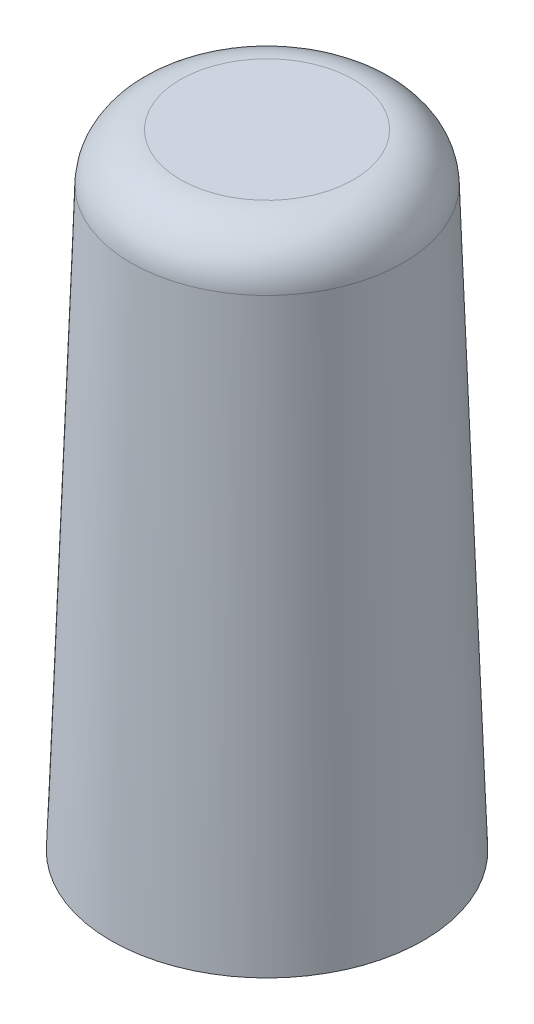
ISO-10303-21;
HEADER;
FILE_DESCRIPTION(('STEP AP214'),'2;1');
FILE_NAME('part.step','',(''),(''),'','','');
FILE_SCHEMA(('AUTOMOTIVE_DESIGN { 1 0 10303 214 1 1 1 1 }'));
ENDSEC;
DATA;
#1=APPLICATION_CONTEXT('core data for automotive mechanical design processes');
#2=APPLICATION_PROTOCOL_DEFINITION('international standard','automotive_design',2000,#1);
#3=PRODUCT_CONTEXT('',#1,'mechanical');
#4=PRODUCT('Part','Part','',(#3));
#5=PRODUCT_RELATED_PRODUCT_CATEGORY('part','',(#4));
#6=PRODUCT_DEFINITION_FORMATION('','',#4);
#7=PRODUCT_DEFINITION_CONTEXT('part definition',#1,'design');
#8=PRODUCT_DEFINITION('design','',#6,#7);
#9=PRODUCT_DEFINITION_SHAPE('','',#8);
#10=(LENGTH_UNIT() NAMED_UNIT(*) SI_UNIT(.MILLI.,.METRE.));
#11=(NAMED_UNIT(*) PLANE_ANGLE_UNIT() SI_UNIT($,.RADIAN.));
#12=(NAMED_UNIT(*) SI_UNIT($,.STERADIAN.) SOLID_ANGLE_UNIT());
#13=UNCERTAINTY_MEASURE_WITH_UNIT(LENGTH_MEASURE(1.E-05),#10,'distance_accuracy_value','');
#14=(GEOMETRIC_REPRESENTATION_CONTEXT(3) GLOBAL_UNCERTAINTY_ASSIGNED_CONTEXT((#13)) GLOBAL_UNIT_ASSIGNED_CONTEXT((#10,
#11,#12)) REPRESENTATION_CONTEXT('',''));
#15=CARTESIAN_POINT('',(0.,0.,0.));
#16=DIRECTION('',(0.,0.,1.));
#17=DIRECTION('',(1.,0.,0.));
#18=AXIS2_PLACEMENT_3D('',#15,#16,#17);
#19=CARTESIAN_POINT('',(0.,0.,0.));
#20=DIRECTION('',(0.,-1.,0.));
#21=DIRECTION('',(0.,0.,1.));
#22=AXIS2_PLACEMENT_3D('',#19,#20,#21);
#23=CONICAL_SURFACE('',#22,9.5,0.0349065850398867);
#24=CARTESIAN_POINT('',(0.,35.1046984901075,0.));
#25=DIRECTION('',(0.,-1.,0.));
#26=DIRECTION('',(0.,0.,-1.));
#27=AXIS2_PLACEMENT_3D('',#24,#25,#26);
#28=CIRCLE('',#27,8.27411691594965);
#29=CARTESIAN_POINT('',(0.,35.1046984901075,-8.27411691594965));
#30=VERTEX_POINT('',#29);
#31=EDGE_CURVE('E10',#30,#30,#28,.T.);
#32=ORIENTED_EDGE('',*,*,#31,.T.);
#33=EDGE_LOOP('',(#32));
#34=FACE_BOUND('',#33,.T.);
#35=CARTESIAN_POINT('',(0.,0.,0.));
#36=DIRECTION('',(0.,1.,0.));
#37=DIRECTION('',(0.,0.,1.));
#38=AXIS2_PLACEMENT_3D('',#35,#36,#37);
#39=CIRCLE('',#38,9.5);
#40=CARTESIAN_POINT('',(0.,0.,9.5));
#41=VERTEX_POINT('',#40);
#42=EDGE_CURVE('E41',#41,#41,#39,.T.);
#43=ORIENTED_EDGE('',*,*,#42,.T.);
#44=EDGE_LOOP('',(#43));
#45=FACE_BOUND('',#44,.T.);
#46=ADVANCED_FACE('F30',(#34,#45),#23,.T.);
#47=CARTESIAN_POINT('',(0.,38.,0.));
#48=DIRECTION('',(0.,1.,0.));
#49=DIRECTION('',(0.,0.,1.));
#50=AXIS2_PLACEMENT_3D('',#47,#48,#49);
#51=PLANE('',#50);
#52=CARTESIAN_POINT('',(0.,38.,0.));
#53=DIRECTION('',(0.,1.,0.));
#54=DIRECTION('',(0.,0.,1.));
#55=AXIS2_PLACEMENT_3D('',#52,#53,#54);
#56=CIRCLE('',#55,5.27594443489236);
#57=CARTESIAN_POINT('',(0.,38.,5.27594443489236));
#58=VERTEX_POINT('',#57);
#59=EDGE_CURVE('E37',#58,#58,#56,.T.);
#60=ORIENTED_EDGE('',*,*,#59,.T.);
#61=EDGE_LOOP('',(#60));
#62=FACE_BOUND('',#61,.T.);
#63=ADVANCED_FACE('F51',(#62),#51,.T.);
#64=CARTESIAN_POINT('',(0.,0.,0.));
#65=DIRECTION('',(0.,1.,0.));
#66=DIRECTION('',(0.,0.,1.));
#67=AXIS2_PLACEMENT_3D('',#64,#65,#66);
#68=PLANE('',#67);
#69=ORIENTED_EDGE('',*,*,#42,.F.);
#70=EDGE_LOOP('',(#69));
#71=FACE_BOUND('',#70,.T.);
#72=ADVANCED_FACE('F49',(#71),#68,.F.);
#73=CARTESIAN_POINT('',(0.,35.,0.));
#74=DIRECTION('',(0.,1.,0.));
#75=DIRECTION('',(0.,0.,1.));
#76=AXIS2_PLACEMENT_3D('',#73,#74,#75);
#77=TOROIDAL_SURFACE('',#76,5.27594443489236,3.);
#78=ORIENTED_EDGE('',*,*,#31,.F.);
#79=EDGE_LOOP('',(#78));
#80=FACE_BOUND('',#79,.T.);
#81=ORIENTED_EDGE('',*,*,#59,.F.);
#82=EDGE_LOOP('',(#81));
#83=FACE_BOUND('',#82,.T.);
#84=ADVANCED_FACE('F32',(#80,#83),#77,.T.);
#85=CLOSED_SHELL('',(#46,#63,#72,#84));
#86=MANIFOLD_SOLID_BREP('B2',#85);
#87=ADVANCED_BREP_SHAPE_REPRESENTATION('',(#18,#86),#14);
#88=SHAPE_DEFINITION_REPRESENTATION(#9,#87);
ENDSEC;
END-ISO-10303-21;
